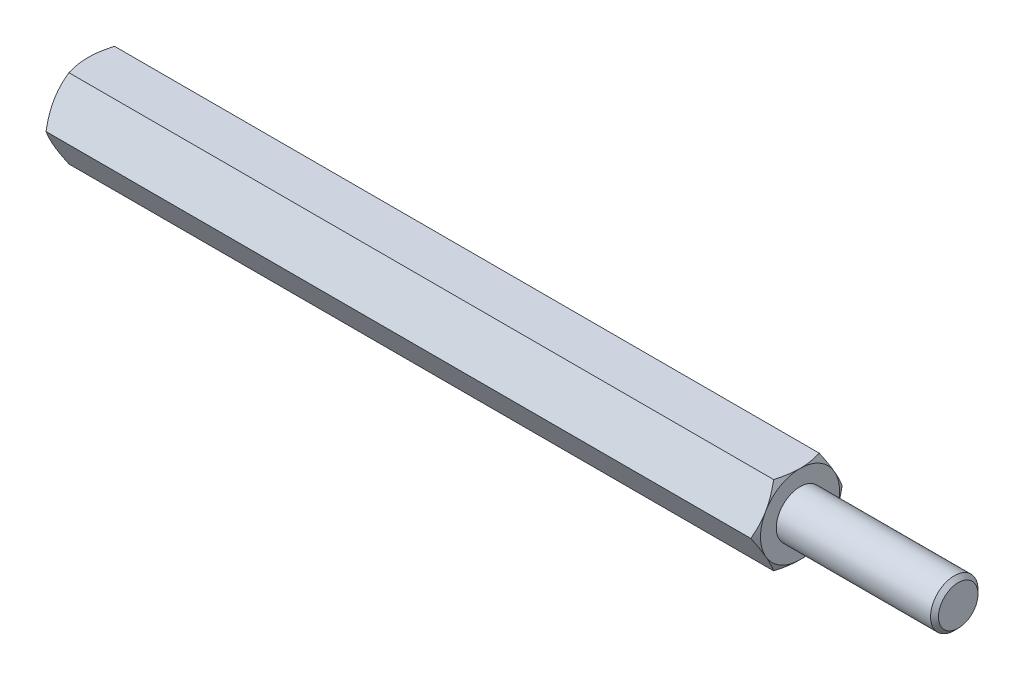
from build123d import *

# Parameters (mm, degrees)
EXTRUDE2_DEPTH = 22.5
SKETCH3_R      = 1.25
EXTRUDE3_DEPTH = 10
SKETCH5_R      = 1.5
EXTRUDE4_DEPTH = 10
CHAMFER1_SIZE  = 0.25


with BuildPart() as part:
    # Sketch1 → Extrude2 (new, symmetric)
    with BuildSketch(Plane(origin=(0, 0, 0), x_dir=(0, 0, -1), z_dir=(1, 0, 0))):
        Polygon((1.443375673, 2.5), (-1.443375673, 2.5), (-2.886751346, 0), (-1.443375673, -2.5), (1.443375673, -2.5), (2.886751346, 0), align=None)
    extrude(amount=EXTRUDE2_DEPTH, both=True)

    # Sketch2 → Cut-Revolve1 (revolve, cut)
    with BuildSketch(Plane.XY):
        with BuildLine():
            Line((-22.5, 2.5), (-21, 5.098076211))
            ThreePointArc((-21, 5.098076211), (-21.48810136, 6.276457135), (-22.5, 5.5))
            Line((-22.5, 5.5), (-22.5, 2.5))
        make_face()
    cut_revolve1 = revolve(axis=Axis((0, 0, 0), (1, 0, 0)), mode=Mode.SUBTRACT)

    # Mirror1: Cut-Revolve1 across plane
    add(cut_revolve1.mirror(Plane(origin=(0, 0, 0), x_dir=(0, 0, 1), z_dir=(1, 0, 0))), mode=Mode.SUBTRACT)

    # Sketch3 → Extrude3 (cut)
    with BuildSketch(Plane.ZY.offset(22.5)):
        Circle(SKETCH3_R)
    extrude(amount=-EXTRUDE3_DEPTH, mode=Mode.SUBTRACT)

    # Sketch4 → Cut-Revolve2 (revolve, cut)
    with BuildSketch(Plane.XY, mode=Mode.PRIVATE) as cut_revolve2_sk:
        Polygon((-12.5, 0), (-12.5, 1.25), (-11.778312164, 0), align=None)
    revolve(cut_revolve2_sk.sketch.rotate(Axis((-11.778312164, 0, 0), (-1, 0, 0)), 270), axis=Axis((-11.778312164, 0, 0), (-1, 0, 0)), mode=Mode.SUBTRACT)

    # Sketch5 → Extrude4 (add)
    with BuildSketch(Plane(origin=(22.5, 0, 0), x_dir=(0, 0, -1), z_dir=(1, 0, 0))):
        Circle(SKETCH5_R)
    extrude(amount=EXTRUDE4_DEPTH)

    # Chamfer1
    chamfer1_edges = [part.edges().sort_by_distance(p)[0] for p in [
        (32.5, 0, 1.5),
    ]]
    chamfer(chamfer1_edges, length=CHAMFER1_SIZE)


solid = part.part
